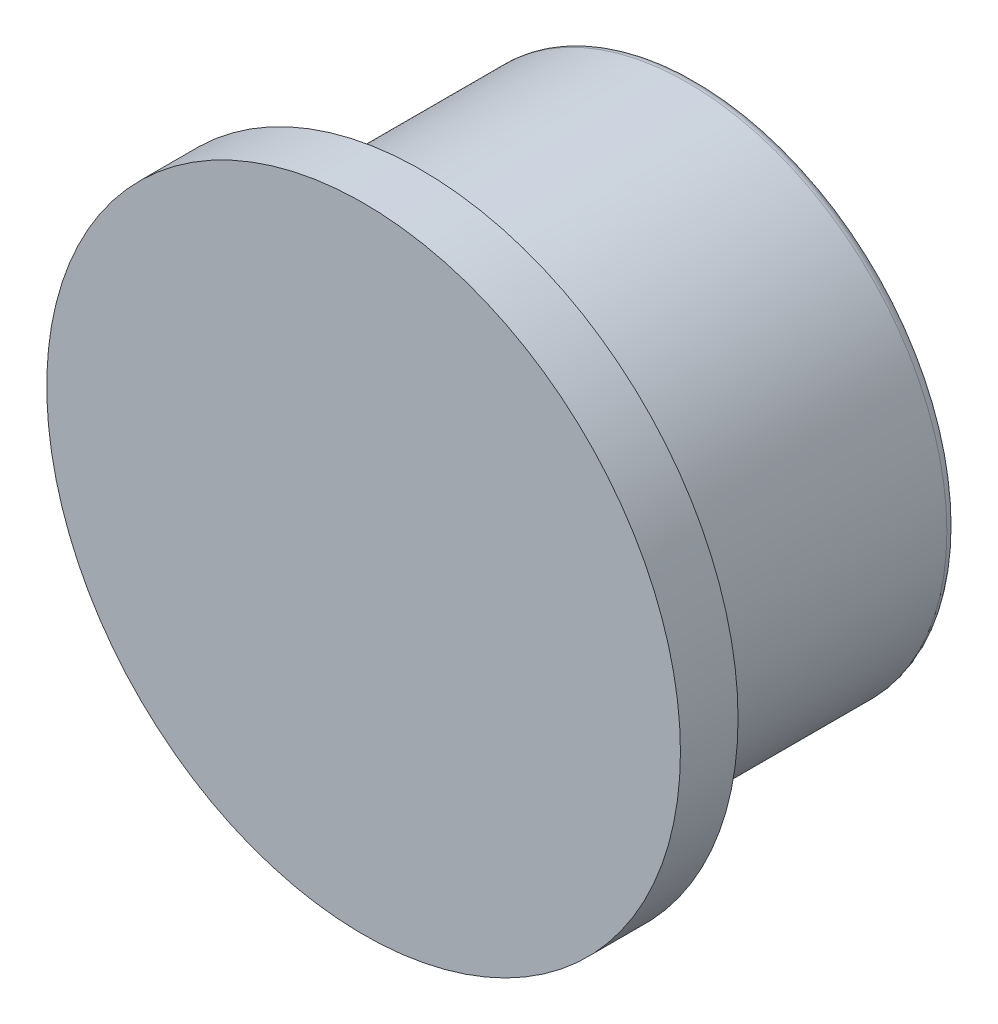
from build123d import *

# Parameters (mm, degrees)
M8X1_0_TAPPED_HOLE1_D           = 7
M8X1_0_TAPPED_HOLE1_DEPTH       = 16
M8X1_0_TAPPED_HOLE1_CSINK_D     = 8.05
M8X1_0_TAPPED_HOLE1_CSINK_ANGLE = 90
M8X1_0_TAPPED_HOLE1_TIP         = 2.103012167


with BuildPart() as part:
    # Sketch1 → Revolve1 (revolve)
    with BuildSketch(Plane(origin=(0, 0, 0), x_dir=(0, 0, -1), z_dir=(1, 0, 0)), mode=Mode.PRIVATE) as revolve1_sk:
        with BuildLine():
            Line((0, 0), (0, 55))
            Line((0, 55), (10, 55))
            Line((10, 55), (10, 45))
            Line((10, 45), (56.25, 45))
            ThreePointArc((56.25, 45), (57.487436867, 44.487436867), (58, 43.25))
            Line((58, 43.25), (58, 0))
            Line((58, 0), (0, 0))
        make_face()
    revolve(revolve1_sk.sketch.rotate(Axis((0, 0, 0), (0, 0, -1)), 90), axis=Axis((0, 0, 0), (0, 0, -1)))

    # M8x1.0 Tapped Hole1
    with Locations(Plane(origin=(0, 0, -58), x_dir=(-1, 0, 0), z_dir=(0, 0, -1))):
        with Locations((0, 0)):
            CounterSinkHole(M8X1_0_TAPPED_HOLE1_D / 2, M8X1_0_TAPPED_HOLE1_CSINK_D / 2, depth=M8X1_0_TAPPED_HOLE1_DEPTH, counter_sink_angle=M8X1_0_TAPPED_HOLE1_CSINK_ANGLE)
            with Locations((0, 0, -(M8X1_0_TAPPED_HOLE1_DEPTH + M8X1_0_TAPPED_HOLE1_TIP / 2))):  # 118° drill point
                Cone(0, M8X1_0_TAPPED_HOLE1_D / 2, M8X1_0_TAPPED_HOLE1_TIP, mode=Mode.SUBTRACT)


solid = part.part
